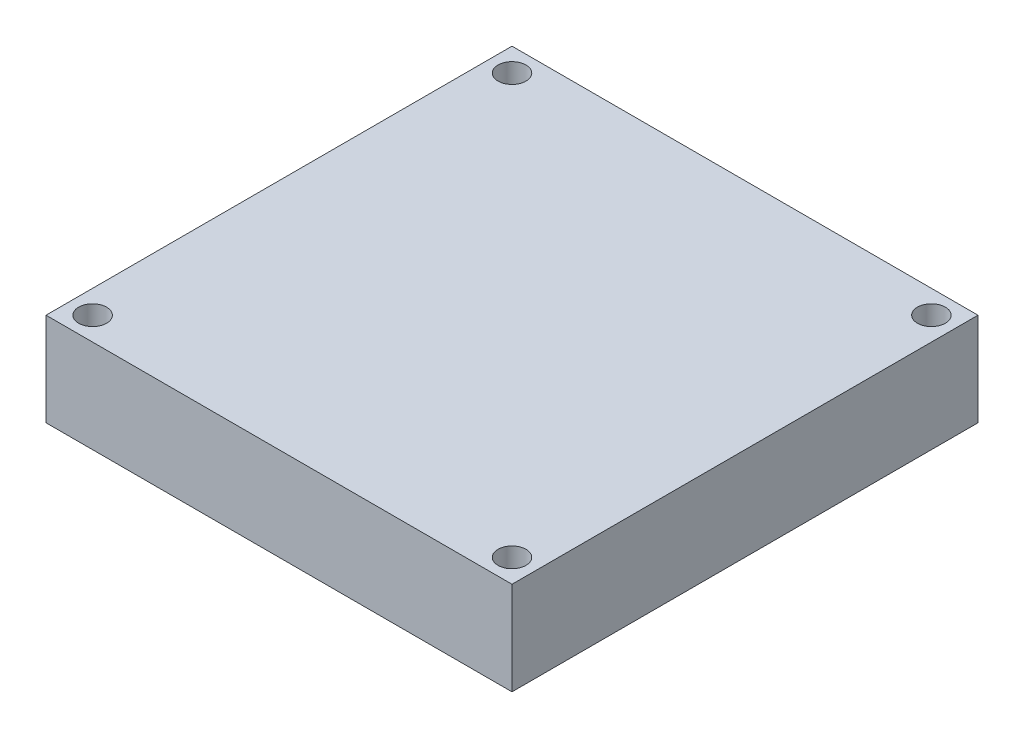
from build123d import *

# Parameters (mm, degrees)
CROQUIS1_W              = 50
CROQUIS1_H              = 50
SALIENTE_EXTRUIR1_DEPTH = 10
CROQUIS3_R              = 1.5
CORTAR_EXTRUIR4_DEPTH   = 10


with BuildPart() as part:
    # Croquis1 → Saliente-Extruir1 (new body)
    with BuildSketch(Plane(origin=(0, 0, 0), x_dir=(1, 0, 0), z_dir=(0, 1, 0))):
        Rectangle(CROQUIS1_W, CROQUIS1_H)
    extrude(amount=SALIENTE_EXTRUIR1_DEPTH)

    # Croquis3 → Cortar-Extruir4 (cut)
    with BuildSketch(Plane(origin=(0, 10, 0), x_dir=(-1, 0, 0), z_dir=(0, 1, 0))):
        with Locations(Location((22.5, -22.5, 0), (0, 0, 90))):
            Circle(CROQUIS3_R)
        with Locations(Location((-22.5, -22.5, 0), (0, 0, 90))):
            Circle(CROQUIS3_R)
        with Locations(Location((22.5, 22.5, 0), (0, 0, 90))):
            Circle(CROQUIS3_R)
        with Locations(Location((-22.5, 22.5, 0), (0, 0, 90))):
            Circle(CROQUIS3_R)
    extrude(amount=-CORTAR_EXTRUIR4_DEPTH, mode=Mode.SUBTRACT)


solid = part.part
